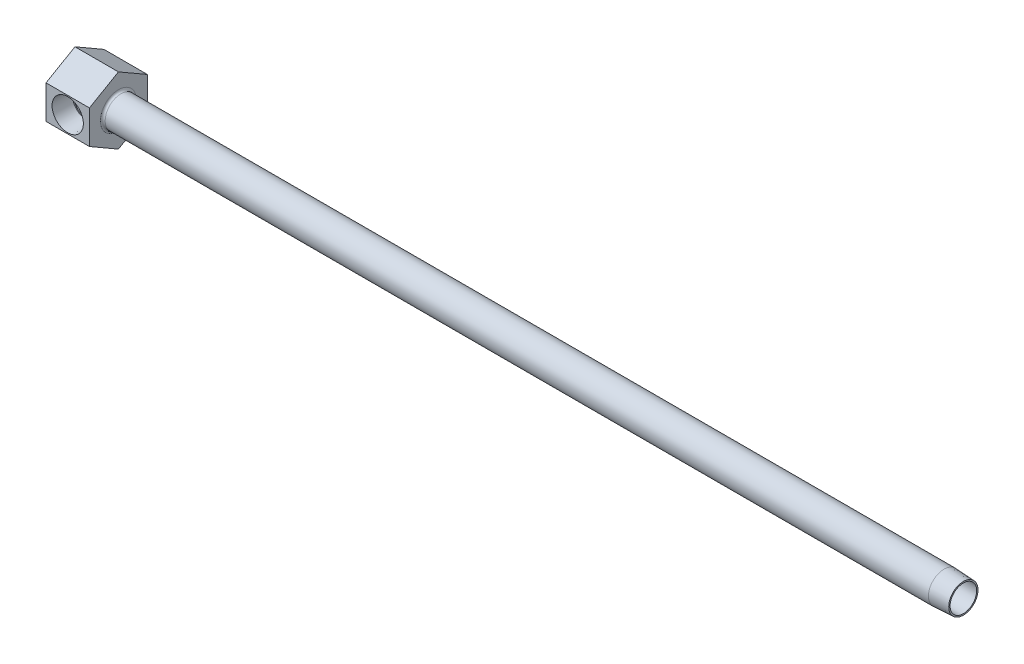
ISO-10303-21;
HEADER;
FILE_DESCRIPTION(('STEP AP214'),'2;1');
FILE_NAME('part.step','',(''),(''),'','','');
FILE_SCHEMA(('AUTOMOTIVE_DESIGN { 1 0 10303 214 1 1 1 1 }'));
ENDSEC;
DATA;
#1=APPLICATION_CONTEXT('core data for automotive mechanical design processes');
#2=APPLICATION_PROTOCOL_DEFINITION('international standard','automotive_design',2000,#1);
#3=PRODUCT_CONTEXT('',#1,'mechanical');
#4=PRODUCT('Part','Part','',(#3));
#5=PRODUCT_RELATED_PRODUCT_CATEGORY('part','',(#4));
#6=PRODUCT_DEFINITION_FORMATION('','',#4);
#7=PRODUCT_DEFINITION_CONTEXT('part definition',#1,'design');
#8=PRODUCT_DEFINITION('design','',#6,#7);
#9=PRODUCT_DEFINITION_SHAPE('','',#8);
#10=(LENGTH_UNIT() NAMED_UNIT(*) SI_UNIT(.MILLI.,.METRE.));
#11=(NAMED_UNIT(*) PLANE_ANGLE_UNIT() SI_UNIT($,.RADIAN.));
#12=(NAMED_UNIT(*) SI_UNIT($,.STERADIAN.) SOLID_ANGLE_UNIT());
#13=UNCERTAINTY_MEASURE_WITH_UNIT(LENGTH_MEASURE(1.E-05),#10,'distance_accuracy_value','');
#14=(GEOMETRIC_REPRESENTATION_CONTEXT(3) GLOBAL_UNCERTAINTY_ASSIGNED_CONTEXT((#13)) GLOBAL_UNIT_ASSIGNED_CONTEXT((#10,
#11,#12)) REPRESENTATION_CONTEXT('',''));
#15=CARTESIAN_POINT('',(0.,0.,0.));
#16=DIRECTION('',(0.,0.,1.));
#17=DIRECTION('',(1.,0.,0.));
#18=AXIS2_PLACEMENT_3D('',#15,#16,#17);
#19=CARTESIAN_POINT('',(7.14375,0.,19.05));
#20=DIRECTION('',(0.,0.,1.));
#21=DIRECTION('',(1.,0.,0.));
#22=AXIS2_PLACEMENT_3D('',#19,#20,#21);
#23=CONICAL_SURFACE('',#22,5.1435,0.0523598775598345);
#24=CARTESIAN_POINT('',(7.14375,0.,19.05));
#25=DIRECTION('',(0.,0.,-1.));
#26=DIRECTION('',(-1.,0.,0.));
#27=AXIS2_PLACEMENT_3D('',#24,#25,#26);
#28=CIRCLE('',#27,5.1435);
#29=CARTESIAN_POINT('',(2.00025,0.,19.05));
#30=VERTEX_POINT('',#29);
#31=EDGE_CURVE('E512',#30,#30,#28,.T.);
#32=ORIENTED_EDGE('',*,*,#31,.F.);
#33=EDGE_LOOP('',(#32));
#34=FACE_BOUND('',#33,.T.);
#35=CARTESIAN_POINT('',(7.14375,0.,12.7000000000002));
#36=DIRECTION('',(0.,0.,-1.));
#37=DIRECTION('',(-1.,0.,0.));
#38=AXIS2_PLACEMENT_3D('',#35,#36,#37);
#39=CIRCLE('',#38,4.81071060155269);
#40=CARTESIAN_POINT('',(10.9073758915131,-2.99634054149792,12.7000000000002));
#41=VERTEX_POINT('',#40);
#42=CARTESIAN_POINT('',(10.9073758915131,2.99634054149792,12.7000000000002));
#43=VERTEX_POINT('',#42);
#44=EDGE_CURVE('E528',#41,#43,#39,.T.);
#45=ORIENTED_EDGE('',*,*,#44,.T.);
#46=CARTESIAN_POINT('',(10.9071937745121,2.99655245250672,12.6998000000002));
#47=CARTESIAN_POINT('',(10.971635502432,2.92155827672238,12.7705639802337));
#48=CARTESIAN_POINT('',(11.0345784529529,2.84341410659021,12.8393139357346));
#49=CARTESIAN_POINT('',(11.1569073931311,2.68056902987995,12.9723675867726));
#50=CARTESIAN_POINT('',(11.2162880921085,2.59585877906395,13.0366646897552));
#51=CARTESIAN_POINT('',(11.3887731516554,2.33059710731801,13.2228141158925));
#52=CARTESIAN_POINT('',(11.4952955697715,2.13996459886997,13.3369144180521));
#53=CARTESIAN_POINT('',(11.6670238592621,1.76978922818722,13.520146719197));
#54=CARTESIAN_POINT('',(11.7362081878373,1.59429861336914,13.5936668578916));
#55=CARTESIAN_POINT('',(11.8243838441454,1.32069459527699,13.6871793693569));
#56=CARTESIAN_POINT('',(11.8511557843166,1.22786736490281,13.7155347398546));
#57=CARTESIAN_POINT('',(11.8990876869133,1.0391950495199,13.7662595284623));
#58=CARTESIAN_POINT('',(11.9202500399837,0.943351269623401,13.7886314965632));
#59=CARTESIAN_POINT('',(11.9566990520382,0.748466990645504,13.8271421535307));
#60=CARTESIAN_POINT('',(11.971935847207,0.649406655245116,13.8432279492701));
#61=CARTESIAN_POINT('',(11.9959472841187,0.449682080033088,13.8685692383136));
#62=CARTESIAN_POINT('',(12.0047249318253,0.349018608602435,13.8778279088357));
#63=CARTESIAN_POINT('',(12.0156291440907,0.146869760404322,13.8893288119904));
#64=CARTESIAN_POINT('',(12.0177517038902,0.0453839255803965,13.8915668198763));
#65=CARTESIAN_POINT('',(12.0152840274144,-0.157407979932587,13.8889645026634));
#66=CARTESIAN_POINT('',(12.0106943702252,-0.258714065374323,13.8841247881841));
#67=CARTESIAN_POINT('',(11.9957865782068,-0.449057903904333,13.8683984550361));
#68=CARTESIAN_POINT('',(11.9861593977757,-0.538211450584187,13.8582411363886));
#69=CARTESIAN_POINT('',(11.961864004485,-0.715062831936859,13.8325939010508));
#70=CARTESIAN_POINT('',(11.9471941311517,-0.802760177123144,13.8171022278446));
#71=CARTESIAN_POINT('',(11.8959888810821,-1.06271154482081,13.762990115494));
#72=CARTESIAN_POINT('',(11.8522396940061,-1.23204639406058,13.7167134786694));
#73=CARTESIAN_POINT('',(11.7458224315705,-1.56656708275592,13.6038703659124));
#74=CARTESIAN_POINT('',(11.6823922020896,-1.73122409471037,13.5364852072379));
#75=CARTESIAN_POINT('',(11.5406571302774,-2.04618319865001,13.3853583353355));
#76=CARTESIAN_POINT('',(11.4623317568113,-2.19646504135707,13.3015940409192));
#77=CARTESIAN_POINT('',(11.3067680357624,-2.45998630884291,13.1343941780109));
#78=CARTESIAN_POINT('',(11.2311482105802,-2.57539375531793,13.0528153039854));
#79=CARTESIAN_POINT('',(11.0735639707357,-2.79452635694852,12.8818550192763));
#80=CARTESIAN_POINT('',(10.9916301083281,-2.89830245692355,12.792510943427));
#81=CARTESIAN_POINT('',(10.9071937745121,-2.99655245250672,12.6998000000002));
#82=B_SPLINE_CURVE_WITH_KNOTS('',3,(#46,#47,#48,#49,#50,#51,#52,#53,#54,#55,#56,#57,#58,#59,#60,
#61,#62,#63,#64,#65,#66,#67,#68,#69,#70,#71,#72,#73,#74,#75,#76,#77,#78,#79,#80,#81),
.UNSPECIFIED.,.F.,.F.,(4,2,2,2,2,2,2,2,2,2,2,2,2,2,2,2,2,4),(0.,0.364634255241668,
0.72979730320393,1.46525067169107,2.06997219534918,2.37170467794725,2.67330836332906,
2.97739780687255,3.28134564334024,3.58547634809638,3.88958081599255,4.15999530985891,
4.43049893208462,4.97084503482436,5.53548493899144,6.10090884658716,6.58103480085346,
7.05896806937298),.UNSPECIFIED.);
#83=EDGE_CURVE('E123',#43,#41,#82,.T.);
#84=ORIENTED_EDGE('',*,*,#83,.T.);
#85=EDGE_LOOP('',(#45,#84));
#86=FACE_BOUND('',#85,.T.);
#87=ADVANCED_FACE('F15',(#34,#86),#23,.F.);
#88=CARTESIAN_POINT('',(11.9544606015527,0.,12.7000000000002));
#89=DIRECTION('',(0.,0.,1.));
#90=DIRECTION('',(1.,0.,0.));
#91=AXIS2_PLACEMENT_3D('',#88,#89,#90);
#92=PLANE('',#91);
#93=ORIENTED_EDGE('',*,*,#44,.F.);
#94=DIRECTION('',(1.,0.,0.));
#95=VECTOR('',#94,1.);
#96=CARTESIAN_POINT('',(66.1375087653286,-2.99634054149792,12.7000000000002));
#97=LINE('',#96,#95);
#98=CARTESIAN_POINT('',(10.3187500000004,-2.99634054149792,12.7000000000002));
#99=VERTEX_POINT('',#98);
#100=EDGE_CURVE('E120',#41,#99,#97,.F.);
#101=ORIENTED_EDGE('',*,*,#100,.T.);
#102=CARTESIAN_POINT('',(7.14375,0.,12.7000000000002));
#103=DIRECTION('',(0.,0.,-1.));
#104=DIRECTION('',(-1.,0.,0.));
#105=AXIS2_PLACEMENT_3D('',#102,#103,#104);
#106=CIRCLE('',#105,4.36562500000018);
#107=CARTESIAN_POINT('',(10.3187500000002,2.99634054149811,12.7000000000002));
#108=VERTEX_POINT('',#107);
#109=EDGE_CURVE('E119',#99,#108,#106,.T.);
#110=ORIENTED_EDGE('',*,*,#109,.T.);
#111=DIRECTION('',(1.,0.,0.));
#112=VECTOR('',#111,1.);
#113=CARTESIAN_POINT('',(66.1375087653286,2.99634054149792,12.7000000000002));
#114=LINE('',#113,#112);
#115=EDGE_CURVE('E126',#108,#43,#114,.T.);
#116=ORIENTED_EDGE('',*,*,#115,.T.);
#117=EDGE_LOOP('',(#93,#101,#110,#116));
#118=FACE_BOUND('',#117,.T.);
#119=ADVANCED_FACE('F156',(#118),#92,.T.);
#120=CARTESIAN_POINT('',(7.14375,0.,35.9059426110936));
#121=DIRECTION('',(0.,0.,-1.));
#122=DIRECTION('',(-1.,0.,0.));
#123=AXIS2_PLACEMENT_3D('',#120,#121,#122);
#124=CYLINDRICAL_SURFACE('',#123,4.36562500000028);
#125=ORIENTED_EDGE('',*,*,#109,.F.);
#126=CARTESIAN_POINT('',(7.14375,0.,9.525));
#127=DIRECTION('',(0.707106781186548,0.,-0.707106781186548));
#128=DIRECTION('',(-0.707106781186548,0.,-0.707106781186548));
#129=AXIS2_PLACEMENT_3D('',#126,#127,#128);
#130=ELLIPSE('',#129,6.17392608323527,4.36562500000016);
#131=CARTESIAN_POINT('',(7.14375,-4.3656250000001,9.525));
#132=VERTEX_POINT('',#131);
#133=EDGE_CURVE('E105',#99,#132,#130,.T.);
#134=ORIENTED_EDGE('',*,*,#133,.T.);
#135=CARTESIAN_POINT('',(7.14375,0.,9.525));
#136=DIRECTION('',(-0.707106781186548,0.,-0.707106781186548));
#137=DIRECTION('',(0.707106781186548,0.,-0.707106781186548));
#138=AXIS2_PLACEMENT_3D('',#135,#136,#137);
#139=ELLIPSE('',#138,6.17392608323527,4.36562500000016);
#140=CARTESIAN_POINT('',(8.98888023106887,-3.95653586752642,7.67986976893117));
#141=VERTEX_POINT('',#140);
#142=EDGE_CURVE('E100',#132,#141,#139,.F.);
#143=ORIENTED_EDGE('',*,*,#142,.T.);
#144=CARTESIAN_POINT('',(7.14375,0.,7.67986976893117));
#145=DIRECTION('',(0.,0.,-1.));
#146=DIRECTION('',(-1.,0.,0.));
#147=AXIS2_PLACEMENT_3D('',#144,#145,#146);
#148=CIRCLE('',#147,4.36562500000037);
#149=CARTESIAN_POINT('',(8.98888023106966,3.95653586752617,7.67986976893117));
#150=VERTEX_POINT('',#149);
#151=EDGE_CURVE('E113',#141,#150,#148,.T.);
#152=ORIENTED_EDGE('',*,*,#151,.T.);
#153=CARTESIAN_POINT('',(7.14375,4.3656250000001,9.525));
#154=VERTEX_POINT('',#153);
#155=EDGE_CURVE('E30',#150,#154,#139,.F.);
#156=ORIENTED_EDGE('',*,*,#155,.T.);
#157=EDGE_CURVE('E122',#154,#108,#130,.T.);
#158=ORIENTED_EDGE('',*,*,#157,.T.);
#159=EDGE_LOOP('',(#125,#134,#143,#152,#156,#158));
#160=FACE_BOUND('',#159,.T.);
#161=ADVANCED_FACE('F116',(#160),#124,.F.);
#162=CARTESIAN_POINT('',(7.14375,0.,7.67986976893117));
#163=DIRECTION('',(0.,0.,1.));
#164=DIRECTION('',(1.,0.,0.));
#165=AXIS2_PLACEMENT_3D('',#162,#163,#164);
#166=CONICAL_SURFACE('',#165,4.36562500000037,1.0471975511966);
#167=ORIENTED_EDGE('',*,*,#151,.F.);
#168=CARTESIAN_POINT('',(8.9894997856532,-3.95662913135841,7.68006976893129));
#169=CARTESIAN_POINT('',(8.91497560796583,-3.94541760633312,7.6560189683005));
#170=CARTESIAN_POINT('',(8.84020256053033,-3.93428272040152,7.6327193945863));
#171=CARTESIAN_POINT('',(8.69001846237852,-3.91242782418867,7.58793860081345));
#172=CARTESIAN_POINT('',(8.61460714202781,-3.90170800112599,7.56645819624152));
#173=CARTESIAN_POINT('',(8.38848524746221,-3.87074056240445,7.50556917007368));
#174=CARTESIAN_POINT('',(8.2367287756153,-3.8515020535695,7.46932807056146));
#175=CARTESIAN_POINT('',(8.00667896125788,-3.82676825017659,7.42384959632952));
#176=CARTESIAN_POINT('',(7.92948623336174,-3.81920348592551,7.41015805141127));
#177=CARTESIAN_POINT('',(7.77441965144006,-3.80585437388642,7.38622945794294));
#178=CARTESIAN_POINT('',(7.69654594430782,-3.80006965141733,7.37599168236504));
#179=CARTESIAN_POINT('',(7.53967894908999,-3.79060206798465,7.35933225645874));
#180=CARTESIAN_POINT('',(7.46068163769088,-3.78693482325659,7.35293894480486));
#181=CARTESIAN_POINT('',(7.30231301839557,-3.7819879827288,7.34434534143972));
#182=CARTESIAN_POINT('',(7.2229414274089,-3.78071064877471,7.34214902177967));
#183=CARTESIAN_POINT('',(7.14355,-3.78074215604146,7.34218750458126));
#184=B_SPLINE_CURVE_WITH_KNOTS('',3,(#168,#169,#170,#171,#172,#173,#174,#175,#176,#177,#178,
#179,#180,#181,#182,#183),.UNSPECIFIED.,.F.,.F.,(4,2,2,2,2,2,2,4),(0.,0.237303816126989,
0.474713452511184,0.945835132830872,1.18204117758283,1.41819746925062,1.65607385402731,
1.89417525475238),.UNSPECIFIED.);
#185=CARTESIAN_POINT('',(7.14375,-3.78074215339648,7.34218750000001));
#186=VERTEX_POINT('',#185);
#187=EDGE_CURVE('E109',#141,#186,#184,.T.);
#188=ORIENTED_EDGE('',*,*,#187,.T.);
#189=DIRECTION('',(0.,0.866025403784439,-0.5));
#190=VECTOR('',#189,1.);
#191=CARTESIAN_POINT('',(7.14375,0.,5.159375));
#192=LINE('',#191,#190);
#193=CARTESIAN_POINT('',(7.14375,0.,5.159375));
#194=VERTEX_POINT('',#193);
#195=EDGE_CURVE('E200',#186,#194,#192,.T.);
#196=ORIENTED_EDGE('',*,*,#195,.T.);
#197=DIRECTION('',(0.,0.866025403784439,0.5));
#198=VECTOR('',#197,1.);
#199=CARTESIAN_POINT('',(7.14375,0.,5.159375));
#200=LINE('',#199,#198);
#201=CARTESIAN_POINT('',(7.14375,3.78074215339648,7.34218750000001));
#202=VERTEX_POINT('',#201);
#203=EDGE_CURVE('E486',#194,#202,#200,.T.);
#204=ORIENTED_EDGE('',*,*,#203,.T.);
#205=CARTESIAN_POINT('',(7.14355,3.78074215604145,7.34218750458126));
#206=CARTESIAN_POINT('',(7.20515303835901,3.78073202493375,7.34217451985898));
#207=CARTESIAN_POINT('',(7.26674694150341,3.78149280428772,7.34348695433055));
#208=CARTESIAN_POINT('',(7.38976236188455,3.78448017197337,7.34867189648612));
#209=CARTESIAN_POINT('',(7.45118394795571,3.78670605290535,7.3525431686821));
#210=CARTESIAN_POINT('',(7.63466542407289,3.79545033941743,7.36782927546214));
#211=CARTESIAN_POINT('',(7.75632841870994,3.80403629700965,7.38291749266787));
#212=CARTESIAN_POINT('',(8.11659337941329,3.83592256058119,7.44024735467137));
#213=CARTESIAN_POINT('',(8.35266311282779,3.8653919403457,7.49460284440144));
#214=CARTESIAN_POINT('',(8.65303625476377,3.90716169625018,7.57737916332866));
#215=CARTESIAN_POINT('',(8.72054620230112,3.91683509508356,7.59689306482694));
#216=CARTESIAN_POINT('',(8.855265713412,3.93652410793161,7.63741882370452));
#217=CARTESIAN_POINT('',(8.92247399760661,3.94654056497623,7.65843453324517));
#218=CARTESIAN_POINT('',(8.9894997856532,3.9566291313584,7.68006976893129));
#219=B_SPLINE_CURVE_WITH_KNOTS('',3,(#205,#206,#207,#208,#209,#210,#211,#212,#213,#214,#215,
#216,#217,#218),.UNSPECIFIED.,.F.,.F.,(4,2,2,2,2,2,4),(0.,0.184774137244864,0.369459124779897,
0.73767480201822,1.46761028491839,1.68043381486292,1.89382432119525),.UNSPECIFIED.);
#220=EDGE_CURVE('E187',#202,#150,#219,.T.);
#221=ORIENTED_EDGE('',*,*,#220,.T.);
#222=EDGE_LOOP('',(#167,#188,#196,#204,#221));
#223=FACE_BOUND('',#222,.T.);
#224=ADVANCED_FACE('F201',(#223),#166,.F.);
#225=CARTESIAN_POINT('',(14.2875,5.4992613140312,19.05));
#226=DIRECTION('',(0.,0.,-1.));
#227=DIRECTION('',(-1.,0.,0.));
#228=AXIS2_PLACEMENT_3D('',#225,#226,#227);
#229=PLANE('',#228);
#230=DIRECTION('',(0.,-1.,0.));
#231=VECTOR('',#230,1.);
#232=CARTESIAN_POINT('',(0.,5.4992613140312,19.05));
#233=LINE('',#232,#231);
#234=CARTESIAN_POINT('',(0.,5.4992613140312,19.05));
#235=VERTEX_POINT('',#234);
#236=CARTESIAN_POINT('',(0.,-5.49926131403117,19.05));
#237=VERTEX_POINT('',#236);
#238=EDGE_CURVE('E515',#235,#237,#233,.T.);
#239=ORIENTED_EDGE('',*,*,#238,.T.);
#240=DIRECTION('',(-1.,0.,0.));
#241=VECTOR('',#240,1.);
#242=CARTESIAN_POINT('',(14.2875,-5.49926131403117,19.05));
#243=LINE('',#242,#241);
#244=CARTESIAN_POINT('',(14.2875,-5.49926131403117,19.05));
#245=VERTEX_POINT('',#244);
#246=EDGE_CURVE('E496',#245,#237,#243,.T.);
#247=ORIENTED_EDGE('',*,*,#246,.F.);
#248=DIRECTION('',(0.,-1.,0.));
#249=VECTOR('',#248,1.);
#250=CARTESIAN_POINT('',(14.2875,5.4992613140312,19.05));
#251=LINE('',#250,#249);
#252=CARTESIAN_POINT('',(14.2875,5.4992613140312,19.05));
#253=VERTEX_POINT('',#252);
#254=EDGE_CURVE('E502',#253,#245,#251,.T.);
#255=ORIENTED_EDGE('',*,*,#254,.F.);
#256=DIRECTION('',(-1.,0.,0.));
#257=VECTOR('',#256,1.);
#258=CARTESIAN_POINT('',(14.2875,5.4992613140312,19.05));
#259=LINE('',#258,#257);
#260=EDGE_CURVE('E493',#253,#235,#259,.T.);
#261=ORIENTED_EDGE('',*,*,#260,.T.);
#262=EDGE_LOOP('',(#239,#247,#255,#261));
#263=FACE_BOUND('',#262,.T.);
#264=ORIENTED_EDGE('',*,*,#31,.T.);
#265=EDGE_LOOP('',(#264));
#266=FACE_BOUND('',#265,.T.);
#267=ADVANCED_FACE('F204',(#263,#266),#229,.F.);
#268=CARTESIAN_POINT('',(14.2875,-5.49926131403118,0.));
#269=DIRECTION('',(1.,0.,0.));
#270=DIRECTION('',(0.,1.,0.));
#271=AXIS2_PLACEMENT_3D('',#268,#269,#270);
#272=PLANE('',#271);
#273=CARTESIAN_POINT('',(14.2875,0.,9.525));
#274=DIRECTION('',(1.,0.,0.));
#275=DIRECTION('',(0.,1.,0.));
#276=AXIS2_PLACEMENT_3D('',#273,#274,#275);
#277=CIRCLE('',#276,5.9309);
#278=CARTESIAN_POINT('',(14.2875,5.9309,9.525));
#279=VERTEX_POINT('',#278);
#280=EDGE_CURVE('E199',#279,#279,#277,.F.);
#281=ORIENTED_EDGE('',*,*,#280,.T.);
#282=EDGE_LOOP('',(#281));
#283=FACE_BOUND('',#282,.T.);
#284=DIRECTION('',(0.,0.5,-0.866025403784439));
#285=VECTOR('',#284,1.);
#286=CARTESIAN_POINT('',(14.2875,-10.9985226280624,9.525));
#287=LINE('',#286,#285);
#288=CARTESIAN_POINT('',(14.2875,-10.9985226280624,9.525));
#289=VERTEX_POINT('',#288);
#290=CARTESIAN_POINT('',(14.2875,-5.49926131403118,0.));
#291=VERTEX_POINT('',#290);
#292=EDGE_CURVE('E473',#289,#291,#287,.T.);
#293=ORIENTED_EDGE('',*,*,#292,.T.);
#294=DIRECTION('',(0.,1.,0.));
#295=VECTOR('',#294,1.);
#296=CARTESIAN_POINT('',(14.2875,-5.49926131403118,0.));
#297=LINE('',#296,#295);
#298=CARTESIAN_POINT('',(14.2875,5.49926131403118,0.));
#299=VERTEX_POINT('',#298);
#300=EDGE_CURVE('E475',#291,#299,#297,.T.);
#301=ORIENTED_EDGE('',*,*,#300,.T.);
#302=DIRECTION('',(0.,0.5,0.866025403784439));
#303=VECTOR('',#302,1.);
#304=CARTESIAN_POINT('',(14.2875,5.49926131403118,0.));
#305=LINE('',#304,#303);
#306=CARTESIAN_POINT('',(14.2875,10.9985226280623,9.525));
#307=VERTEX_POINT('',#306);
#308=EDGE_CURVE('E506',#299,#307,#305,.T.);
#309=ORIENTED_EDGE('',*,*,#308,.T.);
#310=DIRECTION('',(0.,-0.5,0.86602540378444));
#311=VECTOR('',#310,1.);
#312=CARTESIAN_POINT('',(14.2875,10.9985226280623,9.525));
#313=LINE('',#312,#311);
#314=EDGE_CURVE('E504',#307,#253,#313,.T.);
#315=ORIENTED_EDGE('',*,*,#314,.T.);
#316=ORIENTED_EDGE('',*,*,#254,.T.);
#317=DIRECTION('',(0.,-0.5,-0.866025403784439));
#318=VECTOR('',#317,1.);
#319=CARTESIAN_POINT('',(14.2875,-5.49926131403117,19.05));
#320=LINE('',#319,#318);
#321=EDGE_CURVE('E38',#245,#289,#320,.T.);
#322=ORIENTED_EDGE('',*,*,#321,.T.);
#323=EDGE_LOOP('',(#293,#301,#309,#315,#316,#322));
#324=FACE_BOUND('',#323,.T.);
#325=ADVANCED_FACE('F230',(#283,#324),#272,.T.);
#326=CARTESIAN_POINT('',(14.2875,-10.9985226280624,9.525));
#327=DIRECTION('',(0.,0.866025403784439,0.5));
#328=DIRECTION('',(0.,-0.5,0.866025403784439));
#329=AXIS2_PLACEMENT_3D('',#326,#327,#328);
#330=PLANE('',#329);
#331=DIRECTION('',(0.,0.5,-0.866025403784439));
#332=VECTOR('',#331,1.);
#333=CARTESIAN_POINT('',(0.,-10.9985226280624,9.525));
#334=LINE('',#333,#332);
#335=CARTESIAN_POINT('',(0.,-10.9985226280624,9.525));
#336=VERTEX_POINT('',#335);
#337=CARTESIAN_POINT('',(0.,-5.49926131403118,0.));
#338=VERTEX_POINT('',#337);
#339=EDGE_CURVE('E484',#336,#338,#334,.T.);
#340=ORIENTED_EDGE('',*,*,#339,.T.);
#341=DIRECTION('',(-1.,0.,0.));
#342=VECTOR('',#341,1.);
#343=CARTESIAN_POINT('',(14.2875,-5.49926131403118,0.));
#344=LINE('',#343,#342);
#345=EDGE_CURVE('E482',#291,#338,#344,.T.);
#346=ORIENTED_EDGE('',*,*,#345,.F.);
#347=ORIENTED_EDGE('',*,*,#292,.F.);
#348=DIRECTION('',(-1.,0.,0.));
#349=VECTOR('',#348,1.);
#350=CARTESIAN_POINT('',(14.2875,-10.9985226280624,9.525));
#351=LINE('',#350,#349);
#352=EDGE_CURVE('E499',#289,#336,#351,.T.);
#353=ORIENTED_EDGE('',*,*,#352,.T.);
#354=EDGE_LOOP('',(#340,#346,#347,#353));
#355=FACE_BOUND('',#354,.T.);
#356=ADVANCED_FACE('F239',(#355),#330,.F.);
#357=CARTESIAN_POINT('',(14.2875,-5.49926131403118,0.));
#358=DIRECTION('',(0.,0.,1.));
#359=DIRECTION('',(0.,-1.,0.));
#360=AXIS2_PLACEMENT_3D('',#357,#358,#359);
#361=PLANE('',#360);
#362=DIRECTION('',(0.,1.,0.));
#363=VECTOR('',#362,1.);
#364=CARTESIAN_POINT('',(0.,-5.49926131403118,0.));
#365=LINE('',#364,#363);
#366=CARTESIAN_POINT('',(0.,5.49926131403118,0.));
#367=VERTEX_POINT('',#366);
#368=EDGE_CURVE('E511',#338,#367,#365,.T.);
#369=ORIENTED_EDGE('',*,*,#368,.T.);
#370=DIRECTION('',(-1.,0.,0.));
#371=VECTOR('',#370,1.);
#372=CARTESIAN_POINT('',(14.2875,5.49926131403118,0.));
#373=LINE('',#372,#371);
#374=EDGE_CURVE('E485',#299,#367,#373,.T.);
#375=ORIENTED_EDGE('',*,*,#374,.F.);
#376=ORIENTED_EDGE('',*,*,#300,.F.);
#377=ORIENTED_EDGE('',*,*,#345,.T.);
#378=EDGE_LOOP('',(#369,#375,#376,#377));
#379=FACE_BOUND('',#378,.T.);
#380=ADVANCED_FACE('F247',(#379),#361,.F.);
#381=CARTESIAN_POINT('',(14.2875,5.49926131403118,0.));
#382=DIRECTION('',(0.,-0.866025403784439,0.5));
#383=DIRECTION('',(0.,-0.5,-0.866025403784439));
#384=AXIS2_PLACEMENT_3D('',#381,#382,#383);
#385=PLANE('',#384);
#386=DIRECTION('',(0.,0.5,0.866025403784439));
#387=VECTOR('',#386,1.);
#388=CARTESIAN_POINT('',(0.,5.49926131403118,0.));
#389=LINE('',#388,#387);
#390=CARTESIAN_POINT('',(0.,10.9985226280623,9.525));
#391=VERTEX_POINT('',#390);
#392=EDGE_CURVE('E521',#367,#391,#389,.T.);
#393=ORIENTED_EDGE('',*,*,#392,.T.);
#394=DIRECTION('',(-1.,0.,0.));
#395=VECTOR('',#394,1.);
#396=CARTESIAN_POINT('',(14.2875,10.9985226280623,9.525));
#397=LINE('',#396,#395);
#398=EDGE_CURVE('E488',#307,#391,#397,.T.);
#399=ORIENTED_EDGE('',*,*,#398,.F.);
#400=ORIENTED_EDGE('',*,*,#308,.F.);
#401=ORIENTED_EDGE('',*,*,#374,.T.);
#402=EDGE_LOOP('',(#393,#399,#400,#401));
#403=FACE_BOUND('',#402,.T.);
#404=ADVANCED_FACE('F255',(#403),#385,.F.);
#405=CARTESIAN_POINT('',(14.2875,10.9985226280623,9.525));
#406=DIRECTION('',(0.,-0.86602540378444,-0.5));
#407=DIRECTION('',(0.,0.5,-0.86602540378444));
#408=AXIS2_PLACEMENT_3D('',#405,#406,#407);
#409=PLANE('',#408);
#410=DIRECTION('',(0.,-0.5,0.86602540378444));
#411=VECTOR('',#410,1.);
#412=CARTESIAN_POINT('',(0.,10.9985226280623,9.525));
#413=LINE('',#412,#411);
#414=EDGE_CURVE('E518',#391,#235,#413,.T.);
#415=ORIENTED_EDGE('',*,*,#414,.T.);
#416=ORIENTED_EDGE('',*,*,#260,.F.);
#417=ORIENTED_EDGE('',*,*,#314,.F.);
#418=ORIENTED_EDGE('',*,*,#398,.T.);
#419=EDGE_LOOP('',(#415,#416,#417,#418));
#420=FACE_BOUND('',#419,.T.);
#421=ADVANCED_FACE('F264',(#420),#409,.F.);
#422=CARTESIAN_POINT('',(14.2875,-5.49926131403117,19.05));
#423=DIRECTION('',(0.,0.866025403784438,-0.5));
#424=DIRECTION('',(0.,0.5,0.866025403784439));
#425=AXIS2_PLACEMENT_3D('',#422,#423,#424);
#426=PLANE('',#425);
#427=DIRECTION('',(0.,-0.5,-0.866025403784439));
#428=VECTOR('',#427,1.);
#429=CARTESIAN_POINT('',(0.,-5.49926131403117,19.05));
#430=LINE('',#429,#428);
#431=EDGE_CURVE('E478',#237,#336,#430,.T.);
#432=ORIENTED_EDGE('',*,*,#431,.T.);
#433=ORIENTED_EDGE('',*,*,#352,.F.);
#434=ORIENTED_EDGE('',*,*,#321,.F.);
#435=ORIENTED_EDGE('',*,*,#246,.T.);
#436=EDGE_LOOP('',(#432,#433,#434,#435));
#437=FACE_BOUND('',#436,.T.);
#438=ADVANCED_FACE('F273',(#437),#426,.F.);
#439=CARTESIAN_POINT('',(0.,-5.49926131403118,0.));
#440=DIRECTION('',(1.,0.,0.));
#441=DIRECTION('',(0.,1.,0.));
#442=AXIS2_PLACEMENT_3D('',#439,#440,#441);
#443=PLANE('',#442);
#444=ORIENTED_EDGE('',*,*,#339,.F.);
#445=ORIENTED_EDGE('',*,*,#431,.F.);
#446=ORIENTED_EDGE('',*,*,#238,.F.);
#447=ORIENTED_EDGE('',*,*,#414,.F.);
#448=ORIENTED_EDGE('',*,*,#392,.F.);
#449=ORIENTED_EDGE('',*,*,#368,.F.);
#450=EDGE_LOOP('',(#444,#445,#446,#447,#448,#449));
#451=FACE_BOUND('',#450,.T.);
#452=ADVANCED_FACE('F170',(#451),#443,.F.);
#453=CARTESIAN_POINT('',(68.0114010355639,0.,9.525));
#454=DIRECTION('',(-1.,0.,0.));
#455=DIRECTION('',(0.,0.,1.));
#456=AXIS2_PLACEMENT_3D('',#453,#454,#455);
#457=CYLINDRICAL_SURFACE('',#456,5.1435);
#458=CARTESIAN_POINT('',(285.75,0.,9.525));
#459=DIRECTION('',(-1.,0.,0.));
#460=DIRECTION('',(0.,0.,1.));
#461=AXIS2_PLACEMENT_3D('',#458,#459,#460);
#462=CIRCLE('',#461,5.1435);
#463=CARTESIAN_POINT('',(285.75,0.,14.6685));
#464=VERTEX_POINT('',#463);
#465=EDGE_CURVE('E10',#464,#464,#462,.F.);
#466=ORIENTED_EDGE('',*,*,#465,.F.);
#467=EDGE_LOOP('',(#466));
#468=FACE_BOUND('',#467,.T.);
#469=CARTESIAN_POINT('',(15.0749,0.,9.525));
#470=DIRECTION('',(1.,0.,0.));
#471=DIRECTION('',(0.,1.,0.));
#472=AXIS2_PLACEMENT_3D('',#469,#470,#471);
#473=CIRCLE('',#472,5.1435);
#474=CARTESIAN_POINT('',(15.0749,5.1435,9.525));
#475=VERTEX_POINT('',#474);
#476=EDGE_CURVE('E23',#475,#475,#473,.T.);
#477=ORIENTED_EDGE('',*,*,#476,.T.);
#478=EDGE_LOOP('',(#477));
#479=FACE_BOUND('',#478,.T.);
#480=ADVANCED_FACE('F17',(#468,#479),#457,.T.);
#481=CARTESIAN_POINT('',(7.14375,0.,9.525));
#482=DIRECTION('',(1.,0.,0.));
#483=DIRECTION('',(0.,0.,-1.));
#484=AXIS2_PLACEMENT_3D('',#481,#482,#483);
#485=PLANE('',#484);
#486=CARTESIAN_POINT('',(7.14375,0.,9.525));
#487=DIRECTION('',(1.,0.,0.));
#488=DIRECTION('',(0.,0.,-1.));
#489=AXIS2_PLACEMENT_3D('',#486,#487,#488);
#490=CIRCLE('',#489,4.365625);
#491=EDGE_CURVE('E130',#194,#202,#490,.T.);
#492=ORIENTED_EDGE('',*,*,#491,.T.);
#493=ORIENTED_EDGE('',*,*,#203,.F.);
#494=EDGE_LOOP('',(#492,#493));
#495=FACE_BOUND('',#494,.T.);
#496=ADVANCED_FACE('F297',(#495),#485,.T.);
#497=EDGE_CURVE('E128',#186,#194,#490,.T.);
#498=ORIENTED_EDGE('',*,*,#497,.T.);
#499=ORIENTED_EDGE('',*,*,#195,.F.);
#500=EDGE_LOOP('',(#498,#499));
#501=FACE_BOUND('',#500,.T.);
#502=ADVANCED_FACE('F182',(#501),#485,.T.);
#503=CARTESIAN_POINT('',(66.1375087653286,0.,9.525));
#504=DIRECTION('',(1.,0.,0.));
#505=DIRECTION('',(0.,0.,-1.));
#506=AXIS2_PLACEMENT_3D('',#503,#504,#505);
#507=CYLINDRICAL_SURFACE('',#506,4.365625);
#508=ORIENTED_EDGE('',*,*,#142,.F.);
#509=ORIENTED_EDGE('',*,*,#133,.F.);
#510=ORIENTED_EDGE('',*,*,#100,.F.);
#511=ORIENTED_EDGE('',*,*,#83,.F.);
#512=ORIENTED_EDGE('',*,*,#115,.F.);
#513=ORIENTED_EDGE('',*,*,#157,.F.);
#514=ORIENTED_EDGE('',*,*,#155,.F.);
#515=ORIENTED_EDGE('',*,*,#220,.F.);
#516=ORIENTED_EDGE('',*,*,#491,.F.);
#517=ORIENTED_EDGE('',*,*,#497,.F.);
#518=ORIENTED_EDGE('',*,*,#187,.F.);
#519=EDGE_LOOP('',(#508,#509,#510,#511,#512,#513,#514,#515,#516,#517,#518));
#520=FACE_BOUND('',#519,.T.);
#521=CARTESIAN_POINT('',(292.1,0.,9.525));
#522=DIRECTION('',(1.,0.,0.));
#523=DIRECTION('',(0.,0.,-1.));
#524=AXIS2_PLACEMENT_3D('',#521,#522,#523);
#525=CIRCLE('',#524,4.365625);
#526=CARTESIAN_POINT('',(292.1,0.,5.159375));
#527=VERTEX_POINT('',#526);
#528=EDGE_CURVE('E134',#527,#527,#525,.T.);
#529=ORIENTED_EDGE('',*,*,#528,.T.);
#530=EDGE_LOOP('',(#529));
#531=FACE_BOUND('',#530,.T.);
#532=ADVANCED_FACE('F102',(#520,#531),#507,.F.);
#533=CARTESIAN_POINT('',(15.0749,0.,9.525));
#534=DIRECTION('',(1.,0.,0.));
#535=DIRECTION('',(0.,1.,0.));
#536=AXIS2_PLACEMENT_3D('',#533,#534,#535);
#537=TOROIDAL_SURFACE('',#536,5.9309,0.7874);
#538=ORIENTED_EDGE('',*,*,#476,.F.);
#539=EDGE_LOOP('',(#538));
#540=FACE_BOUND('',#539,.T.);
#541=ORIENTED_EDGE('',*,*,#280,.F.);
#542=EDGE_LOOP('',(#541));
#543=FACE_BOUND('',#542,.T.);
#544=ADVANCED_FACE('F153',(#540,#543),#537,.F.);
#545=CARTESIAN_POINT('',(292.1,0.,5.159375));
#546=DIRECTION('',(1.,0.,0.));
#547=DIRECTION('',(0.,0.,-1.));
#548=AXIS2_PLACEMENT_3D('',#545,#546,#547);
#549=PLANE('',#548);
#550=CARTESIAN_POINT('',(292.1,0.,9.525));
#551=DIRECTION('',(1.,0.,0.));
#552=DIRECTION('',(0.,0.,-1.));
#553=AXIS2_PLACEMENT_3D('',#550,#551,#552);
#554=CIRCLE('',#553,4.81071060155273);
#555=CARTESIAN_POINT('',(292.1,0.,4.71428939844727));
#556=VERTEX_POINT('',#555);
#557=EDGE_CURVE('E137',#556,#556,#554,.T.);
#558=ORIENTED_EDGE('',*,*,#557,.T.);
#559=EDGE_LOOP('',(#558));
#560=FACE_BOUND('',#559,.T.);
#561=ORIENTED_EDGE('',*,*,#528,.F.);
#562=EDGE_LOOP('',(#561));
#563=FACE_BOUND('',#562,.T.);
#564=ADVANCED_FACE('F141',(#560,#563),#549,.T.);
#565=CARTESIAN_POINT('',(292.1,0.,9.525));
#566=DIRECTION('',(-1.,0.,0.));
#567=DIRECTION('',(0.,0.,1.));
#568=AXIS2_PLACEMENT_3D('',#565,#566,#567);
#569=CONICAL_SURFACE('',#568,4.81071060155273,0.0523598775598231);
#570=ORIENTED_EDGE('',*,*,#465,.T.);
#571=EDGE_LOOP('',(#570));
#572=FACE_BOUND('',#571,.T.);
#573=ORIENTED_EDGE('',*,*,#557,.F.);
#574=EDGE_LOOP('',(#573));
#575=FACE_BOUND('',#574,.T.);
#576=ADVANCED_FACE('F144',(#572,#575),#569,.T.);
#577=CLOSED_SHELL('',(#87,#119,#161,#224,#267,#325,#356,#380,#404,#421,#438,#452,#480,#496,#502,
#532,#544,#564,#576));
#578=MANIFOLD_SOLID_BREP('B1',#577);
#579=ADVANCED_BREP_SHAPE_REPRESENTATION('',(#18,#578),#14);
#580=SHAPE_DEFINITION_REPRESENTATION(#9,#579);
ENDSEC;
END-ISO-10303-21;
